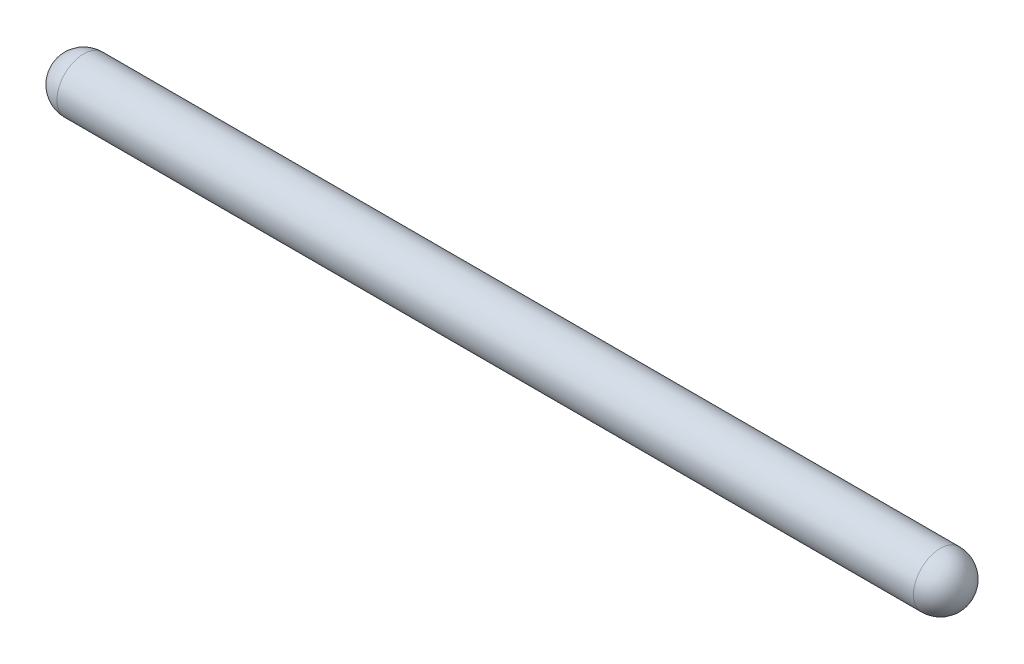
ISO-10303-21;
HEADER;
FILE_DESCRIPTION(('STEP AP214'),'2;1');
FILE_NAME('part.step','',(''),(''),'','','');
FILE_SCHEMA(('AUTOMOTIVE_DESIGN { 1 0 10303 214 1 1 1 1 }'));
ENDSEC;
DATA;
#1=APPLICATION_CONTEXT('core data for automotive mechanical design processes');
#2=APPLICATION_PROTOCOL_DEFINITION('international standard','automotive_design',2000,#1);
#3=PRODUCT_CONTEXT('',#1,'mechanical');
#4=PRODUCT('Part','Part','',(#3));
#5=PRODUCT_RELATED_PRODUCT_CATEGORY('part','',(#4));
#6=PRODUCT_DEFINITION_FORMATION('','',#4);
#7=PRODUCT_DEFINITION_CONTEXT('part definition',#1,'design');
#8=PRODUCT_DEFINITION('design','',#6,#7);
#9=PRODUCT_DEFINITION_SHAPE('','',#8);
#10=(LENGTH_UNIT() NAMED_UNIT(*) SI_UNIT(.MILLI.,.METRE.));
#11=(NAMED_UNIT(*) PLANE_ANGLE_UNIT() SI_UNIT($,.RADIAN.));
#12=(NAMED_UNIT(*) SI_UNIT($,.STERADIAN.) SOLID_ANGLE_UNIT());
#13=UNCERTAINTY_MEASURE_WITH_UNIT(LENGTH_MEASURE(1.E-05),#10,'distance_accuracy_value','');
#14=(GEOMETRIC_REPRESENTATION_CONTEXT(3) GLOBAL_UNCERTAINTY_ASSIGNED_CONTEXT((#13)) GLOBAL_UNIT_ASSIGNED_CONTEXT((#10,
#11,#12)) REPRESENTATION_CONTEXT('',''));
#15=CARTESIAN_POINT('',(0.,0.,0.));
#16=DIRECTION('',(0.,0.,1.));
#17=DIRECTION('',(1.,0.,0.));
#18=AXIS2_PLACEMENT_3D('',#15,#16,#17);
#19=CARTESIAN_POINT('',(0.,-25.,0.));
#20=DIRECTION('',(1.,0.,0.));
#21=DIRECTION('',(0.,0.,-1.));
#22=AXIS2_PLACEMENT_3D('',#19,#20,#21);
#23=CYLINDRICAL_SURFACE('',#22,2.5);
#24=CARTESIAN_POINT('',(80.,-25.,0.));
#25=DIRECTION('',(-1.,0.,0.));
#26=DIRECTION('',(0.,-1.,0.));
#27=AXIS2_PLACEMENT_3D('',#24,#25,#26);
#28=CIRCLE('',#27,2.5);
#29=CARTESIAN_POINT('',(80.,-25.,-2.5));
#30=VERTEX_POINT('',#29);
#31=CARTESIAN_POINT('',(80.,-25.,2.5));
#32=VERTEX_POINT('',#31);
#33=EDGE_CURVE('E11',#30,#32,#28,.T.);
#34=ORIENTED_EDGE('',*,*,#33,.T.);
#35=CARTESIAN_POINT('',(80.,-25.,0.));
#36=DIRECTION('',(1.,0.,0.));
#37=DIRECTION('',(0.,1.,0.));
#38=AXIS2_PLACEMENT_3D('',#35,#36,#37);
#39=CIRCLE('',#38,2.5);
#40=EDGE_CURVE('E24',#30,#32,#39,.T.);
#41=ORIENTED_EDGE('',*,*,#40,.F.);
#42=EDGE_LOOP('',(#34,#41));
#43=FACE_BOUND('',#42,.T.);
#44=CARTESIAN_POINT('',(0.,-25.,0.));
#45=DIRECTION('',(-1.,0.,0.));
#46=DIRECTION('',(0.,-1.,0.));
#47=AXIS2_PLACEMENT_3D('',#44,#45,#46);
#48=CIRCLE('',#47,2.5);
#49=CARTESIAN_POINT('',(0.,-25.,-2.5));
#50=VERTEX_POINT('',#49);
#51=CARTESIAN_POINT('',(0.,-25.,2.5));
#52=VERTEX_POINT('',#51);
#53=EDGE_CURVE('E30',#50,#52,#48,.T.);
#54=ORIENTED_EDGE('',*,*,#53,.F.);
#55=CARTESIAN_POINT('',(0.,-25.,0.));
#56=DIRECTION('',(1.,0.,0.));
#57=DIRECTION('',(0.,1.,0.));
#58=AXIS2_PLACEMENT_3D('',#55,#56,#57);
#59=CIRCLE('',#58,2.5);
#60=EDGE_CURVE('E40',#50,#52,#59,.T.);
#61=ORIENTED_EDGE('',*,*,#60,.T.);
#62=EDGE_LOOP('',(#54,#61));
#63=FACE_BOUND('',#62,.T.);
#64=ADVANCED_FACE('F16',(#43,#63),#23,.T.);
#65=CARTESIAN_POINT('',(80.,-25.,0.));
#66=DIRECTION('',(0.,0.,1.));
#67=DIRECTION('',(0.,-1.,0.));
#68=AXIS2_PLACEMENT_3D('',#65,#66,#67);
#69=SPHERICAL_SURFACE('',#68,2.5);
#70=CARTESIAN_POINT('',(80.,-25.,0.));
#71=DIRECTION('',(-1.,0.,0.));
#72=DIRECTION('',(0.,-1.,0.));
#73=AXIS2_PLACEMENT_3D('',#70,#71,#72);
#74=SPHERICAL_SURFACE('',#73,2.5);
#75=ORIENTED_EDGE('',*,*,#33,.F.);
#76=ORIENTED_EDGE('',*,*,#40,.T.);
#77=EDGE_LOOP('',(#75,#76));
#78=FACE_BOUND('',#77,.T.);
#79=ADVANCED_FACE('F62',(#78),#74,.T.);
#80=CARTESIAN_POINT('',(0.,-25.,0.));
#81=DIRECTION('',(0.,0.,1.));
#82=DIRECTION('',(0.,1.,0.));
#83=AXIS2_PLACEMENT_3D('',#80,#81,#82);
#84=SPHERICAL_SURFACE('',#83,2.5);
#85=CARTESIAN_POINT('',(0.,-25.,0.));
#86=DIRECTION('',(1.,0.,0.));
#87=DIRECTION('',(0.,1.,0.));
#88=AXIS2_PLACEMENT_3D('',#85,#86,#87);
#89=SPHERICAL_SURFACE('',#88,2.5);
#90=ORIENTED_EDGE('',*,*,#60,.F.);
#91=ORIENTED_EDGE('',*,*,#53,.T.);
#92=EDGE_LOOP('',(#90,#91));
#93=FACE_BOUND('',#92,.T.);
#94=ADVANCED_FACE('F41',(#93),#89,.T.);
#95=CLOSED_SHELL('',(#64,#79,#94));
#96=MANIFOLD_SOLID_BREP('B1',#95);
#97=ADVANCED_BREP_SHAPE_REPRESENTATION('',(#18,#96),#14);
#98=SHAPE_DEFINITION_REPRESENTATION(#9,#97);
ENDSEC;
END-ISO-10303-21;
